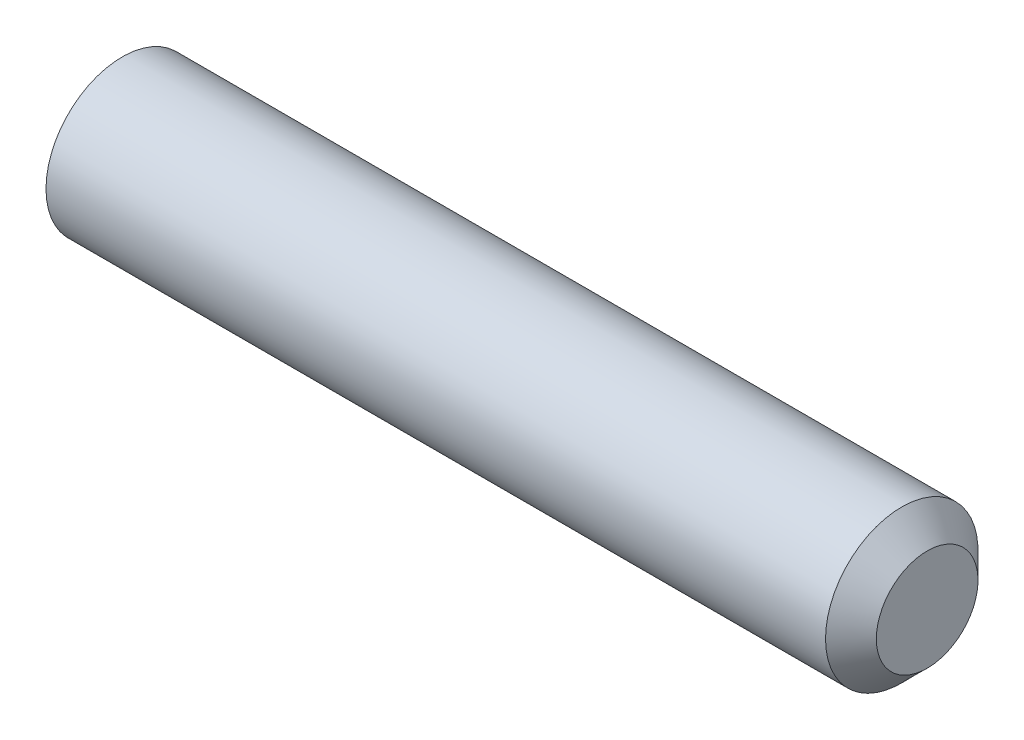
ISO-10303-21;
HEADER;
FILE_DESCRIPTION(('STEP AP214'),'2;1');
FILE_NAME('part.step','',(''),(''),'','','');
FILE_SCHEMA(('AUTOMOTIVE_DESIGN { 1 0 10303 214 1 1 1 1 }'));
ENDSEC;
DATA;
#1=APPLICATION_CONTEXT('core data for automotive mechanical design processes');
#2=APPLICATION_PROTOCOL_DEFINITION('international standard','automotive_design',2000,#1);
#3=PRODUCT_CONTEXT('',#1,'mechanical');
#4=PRODUCT('Part','Part','',(#3));
#5=PRODUCT_RELATED_PRODUCT_CATEGORY('part','',(#4));
#6=PRODUCT_DEFINITION_FORMATION('','',#4);
#7=PRODUCT_DEFINITION_CONTEXT('part definition',#1,'design');
#8=PRODUCT_DEFINITION('design','',#6,#7);
#9=PRODUCT_DEFINITION_SHAPE('','',#8);
#10=(LENGTH_UNIT() NAMED_UNIT(*) SI_UNIT(.MILLI.,.METRE.));
#11=(NAMED_UNIT(*) PLANE_ANGLE_UNIT() SI_UNIT($,.RADIAN.));
#12=(NAMED_UNIT(*) SI_UNIT($,.STERADIAN.) SOLID_ANGLE_UNIT());
#13=UNCERTAINTY_MEASURE_WITH_UNIT(LENGTH_MEASURE(1.E-05),#10,'distance_accuracy_value','');
#14=(GEOMETRIC_REPRESENTATION_CONTEXT(3) GLOBAL_UNCERTAINTY_ASSIGNED_CONTEXT((#13)) GLOBAL_UNIT_ASSIGNED_CONTEXT((#10,
#11,#12)) REPRESENTATION_CONTEXT('',''));
#15=CARTESIAN_POINT('',(0.,0.,0.));
#16=DIRECTION('',(0.,0.,1.));
#17=DIRECTION('',(1.,0.,0.));
#18=AXIS2_PLACEMENT_3D('',#15,#16,#17);
#19=CARTESIAN_POINT('',(0.,0.,0.));
#20=DIRECTION('',(-1.,0.,0.));
#21=DIRECTION('',(0.,0.,1.));
#22=AXIS2_PLACEMENT_3D('',#19,#20,#21);
#23=PLANE('',#22);
#24=CARTESIAN_POINT('',(0.,0.,0.));
#25=DIRECTION('',(-1.,0.,0.));
#26=DIRECTION('',(0.,0.,1.));
#27=AXIS2_PLACEMENT_3D('',#24,#25,#26);
#28=CIRCLE('',#27,1.2195);
#29=CARTESIAN_POINT('',(0.,0.,1.2195));
#30=VERTEX_POINT('',#29);
#31=EDGE_CURVE('E133',#30,#30,#28,.T.);
#32=ORIENTED_EDGE('',*,*,#31,.T.);
#33=EDGE_LOOP('',(#32));
#34=FACE_BOUND('',#33,.T.);
#35=DIRECTION('',(0.,0.,-1.));
#36=VECTOR('',#35,1.);
#37=CARTESIAN_POINT('',(0.,0.750000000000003,0.433012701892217));
#38=LINE('',#37,#36);
#39=CARTESIAN_POINT('',(0.,0.750000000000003,0.433012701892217));
#40=VERTEX_POINT('',#39);
#41=CARTESIAN_POINT('',(0.,0.750000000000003,-0.433012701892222));
#42=VERTEX_POINT('',#41);
#43=EDGE_CURVE('E124',#40,#42,#38,.T.);
#44=ORIENTED_EDGE('',*,*,#43,.F.);
#45=DIRECTION('',(0.,-0.866025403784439,0.499999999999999));
#46=VECTOR('',#45,1.);
#47=CARTESIAN_POINT('',(0.,0.750000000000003,0.433012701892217));
#48=LINE('',#47,#46);
#49=CARTESIAN_POINT('',(0.,0.,0.866025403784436));
#50=VERTEX_POINT('',#49);
#51=EDGE_CURVE('E46',#40,#50,#48,.T.);
#52=ORIENTED_EDGE('',*,*,#51,.T.);
#53=DIRECTION('',(0.,0.866025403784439,0.5));
#54=VECTOR('',#53,1.);
#55=CARTESIAN_POINT('',(0.,-0.749999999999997,0.433012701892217));
#56=LINE('',#55,#54);
#57=CARTESIAN_POINT('',(0.,-0.749999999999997,0.433012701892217));
#58=VERTEX_POINT('',#57);
#59=EDGE_CURVE('E115',#58,#50,#56,.T.);
#60=ORIENTED_EDGE('',*,*,#59,.F.);
#61=DIRECTION('',(0.,0.,-1.));
#62=VECTOR('',#61,1.);
#63=CARTESIAN_POINT('',(0.,-0.749999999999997,0.433012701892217));
#64=LINE('',#63,#62);
#65=CARTESIAN_POINT('',(0.,-0.749999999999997,-0.433012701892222));
#66=VERTEX_POINT('',#65);
#67=EDGE_CURVE('E118',#58,#66,#64,.T.);
#68=ORIENTED_EDGE('',*,*,#67,.T.);
#69=DIRECTION('',(0.,0.866025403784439,-0.5));
#70=VECTOR('',#69,1.);
#71=CARTESIAN_POINT('',(0.,-0.749999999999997,-0.433012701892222));
#72=LINE('',#71,#70);
#73=CARTESIAN_POINT('',(0.,0.,-0.866025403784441));
#74=VERTEX_POINT('',#73);
#75=EDGE_CURVE('E121',#66,#74,#72,.T.);
#76=ORIENTED_EDGE('',*,*,#75,.T.);
#77=DIRECTION('',(0.,-0.866025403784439,-0.5));
#78=VECTOR('',#77,1.);
#79=CARTESIAN_POINT('',(0.,0.750000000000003,-0.433012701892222));
#80=LINE('',#79,#78);
#81=EDGE_CURVE('E104',#42,#74,#80,.T.);
#82=ORIENTED_EDGE('',*,*,#81,.F.);
#83=EDGE_LOOP('',(#44,#52,#60,#68,#76,#82));
#84=FACE_BOUND('',#83,.T.);
#85=ADVANCED_FACE('F31',(#34,#84),#23,.T.);
#86=CARTESIAN_POINT('',(16.,1.,0.));
#87=DIRECTION('',(1.,0.,0.));
#88=DIRECTION('',(0.,0.,-1.));
#89=AXIS2_PLACEMENT_3D('',#86,#87,#88);
#90=PLANE('',#89);
#91=CARTESIAN_POINT('',(16.,0.,0.));
#92=DIRECTION('',(-1.,0.,0.));
#93=DIRECTION('',(0.,0.,1.));
#94=AXIS2_PLACEMENT_3D('',#91,#92,#93);
#95=CIRCLE('',#94,1.);
#96=CARTESIAN_POINT('',(16.,0.,1.));
#97=VERTEX_POINT('',#96);
#98=EDGE_CURVE('E11',#97,#97,#95,.T.);
#99=ORIENTED_EDGE('',*,*,#98,.F.);
#100=EDGE_LOOP('',(#99));
#101=FACE_BOUND('',#100,.T.);
#102=ADVANCED_FACE('F33',(#101),#90,.T.);
#103=CARTESIAN_POINT('',(15.5,0.,0.));
#104=DIRECTION('',(-1.,0.,0.));
#105=DIRECTION('',(0.,0.,1.));
#106=AXIS2_PLACEMENT_3D('',#103,#104,#105);
#107=CONICAL_SURFACE('',#106,1.5,0.785398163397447);
#108=ORIENTED_EDGE('',*,*,#98,.T.);
#109=EDGE_LOOP('',(#108));
#110=FACE_BOUND('',#109,.T.);
#111=CARTESIAN_POINT('',(15.5,0.,0.));
#112=DIRECTION('',(-1.,0.,0.));
#113=DIRECTION('',(0.,0.,1.));
#114=AXIS2_PLACEMENT_3D('',#111,#112,#113);
#115=CIRCLE('',#114,1.5);
#116=CARTESIAN_POINT('',(15.5,0.,1.5));
#117=VERTEX_POINT('',#116);
#118=EDGE_CURVE('E39',#117,#117,#115,.T.);
#119=ORIENTED_EDGE('',*,*,#118,.F.);
#120=EDGE_LOOP('',(#119));
#121=FACE_BOUND('',#120,.T.);
#122=ADVANCED_FACE('F144',(#110,#121),#107,.T.);
#123=CARTESIAN_POINT('',(-12.7,0.,0.));
#124=DIRECTION('',(-1.,0.,0.));
#125=DIRECTION('',(0.,0.,1.));
#126=AXIS2_PLACEMENT_3D('',#123,#124,#125);
#127=CYLINDRICAL_SURFACE('',#126,1.5);
#128=ORIENTED_EDGE('',*,*,#118,.T.);
#129=EDGE_LOOP('',(#128));
#130=FACE_BOUND('',#129,.T.);
#131=CARTESIAN_POINT('',(0.161946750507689,0.,0.));
#132=DIRECTION('',(-1.,0.,0.));
#133=DIRECTION('',(0.,0.,1.));
#134=AXIS2_PLACEMENT_3D('',#131,#132,#133);
#135=CIRCLE('',#134,1.5);
#136=CARTESIAN_POINT('',(0.161946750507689,0.,1.5));
#137=VERTEX_POINT('',#136);
#138=EDGE_CURVE('E136',#137,#137,#135,.T.);
#139=ORIENTED_EDGE('',*,*,#138,.F.);
#140=EDGE_LOOP('',(#139));
#141=FACE_BOUND('',#140,.T.);
#142=ADVANCED_FACE('F141',(#130,#141),#127,.T.);
#143=CARTESIAN_POINT('',(0.,0.,0.));
#144=DIRECTION('',(1.,0.,0.));
#145=DIRECTION('',(0.,0.,-1.));
#146=AXIS2_PLACEMENT_3D('',#143,#144,#145);
#147=CONICAL_SURFACE('',#146,1.2195,1.0471975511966);
#148=ORIENTED_EDGE('',*,*,#138,.T.);
#149=EDGE_LOOP('',(#148));
#150=FACE_BOUND('',#149,.T.);
#151=ORIENTED_EDGE('',*,*,#31,.F.);
#152=EDGE_LOOP('',(#151));
#153=FACE_BOUND('',#152,.T.);
#154=ADVANCED_FACE('F151',(#150,#153),#147,.T.);
#155=CARTESIAN_POINT('',(2.,0.750000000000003,0.433012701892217));
#156=DIRECTION('',(0.,-0.5,-0.866025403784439));
#157=DIRECTION('',(0.,0.866025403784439,-0.5));
#158=AXIS2_PLACEMENT_3D('',#155,#156,#157);
#159=PLANE('',#158);
#160=ORIENTED_EDGE('',*,*,#51,.F.);
#161=DIRECTION('',(-1.,0.,0.));
#162=VECTOR('',#161,1.);
#163=CARTESIAN_POINT('',(2.,0.750000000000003,0.433012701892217));
#164=LINE('',#163,#162);
#165=CARTESIAN_POINT('',(2.,0.750000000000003,0.433012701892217));
#166=VERTEX_POINT('',#165);
#167=EDGE_CURVE('E51',#166,#40,#164,.T.);
#168=ORIENTED_EDGE('',*,*,#167,.F.);
#169=DIRECTION('',(0.,-0.866025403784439,0.499999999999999));
#170=VECTOR('',#169,1.);
#171=CARTESIAN_POINT('',(2.,0.750000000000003,0.433012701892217));
#172=LINE('',#171,#170);
#173=CARTESIAN_POINT('',(2.,0.,0.866025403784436));
#174=VERTEX_POINT('',#173);
#175=EDGE_CURVE('E78',#166,#174,#172,.T.);
#176=ORIENTED_EDGE('',*,*,#175,.T.);
#177=DIRECTION('',(-1.,0.,0.));
#178=VECTOR('',#177,1.);
#179=CARTESIAN_POINT('',(2.,0.,0.866025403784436));
#180=LINE('',#179,#178);
#181=EDGE_CURVE('E131',#174,#50,#180,.T.);
#182=ORIENTED_EDGE('',*,*,#181,.T.);
#183=EDGE_LOOP('',(#160,#168,#176,#182));
#184=FACE_BOUND('',#183,.T.);
#185=ADVANCED_FACE('F162',(#184),#159,.T.);
#186=CARTESIAN_POINT('',(2.,-0.749999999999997,0.433012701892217));
#187=DIRECTION('',(0.,-0.5,0.866025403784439));
#188=DIRECTION('',(0.,-0.866025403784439,-0.5));
#189=AXIS2_PLACEMENT_3D('',#186,#187,#188);
#190=PLANE('',#189);
#191=ORIENTED_EDGE('',*,*,#59,.T.);
#192=ORIENTED_EDGE('',*,*,#181,.F.);
#193=DIRECTION('',(0.,0.866025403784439,0.5));
#194=VECTOR('',#193,1.);
#195=CARTESIAN_POINT('',(2.,-0.749999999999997,0.433012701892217));
#196=LINE('',#195,#194);
#197=CARTESIAN_POINT('',(2.,-0.749999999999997,0.433012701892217));
#198=VERTEX_POINT('',#197);
#199=EDGE_CURVE('E260',#198,#174,#196,.T.);
#200=ORIENTED_EDGE('',*,*,#199,.F.);
#201=DIRECTION('',(-1.,0.,0.));
#202=VECTOR('',#201,1.);
#203=CARTESIAN_POINT('',(2.,-0.749999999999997,0.433012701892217));
#204=LINE('',#203,#202);
#205=EDGE_CURVE('E129',#198,#58,#204,.T.);
#206=ORIENTED_EDGE('',*,*,#205,.T.);
#207=EDGE_LOOP('',(#191,#192,#200,#206));
#208=FACE_BOUND('',#207,.T.);
#209=ADVANCED_FACE('F169',(#208),#190,.F.);
#210=CARTESIAN_POINT('',(2.,-0.749999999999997,0.433012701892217));
#211=DIRECTION('',(0.,1.,0.));
#212=DIRECTION('',(0.,0.,1.));
#213=AXIS2_PLACEMENT_3D('',#210,#211,#212);
#214=PLANE('',#213);
#215=ORIENTED_EDGE('',*,*,#67,.F.);
#216=ORIENTED_EDGE('',*,*,#205,.F.);
#217=DIRECTION('',(0.,0.,-1.));
#218=VECTOR('',#217,1.);
#219=CARTESIAN_POINT('',(2.,-0.749999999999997,0.433012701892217));
#220=LINE('',#219,#218);
#221=CARTESIAN_POINT('',(2.,-0.749999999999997,-0.433012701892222));
#222=VERTEX_POINT('',#221);
#223=EDGE_CURVE('E99',#198,#222,#220,.T.);
#224=ORIENTED_EDGE('',*,*,#223,.T.);
#225=DIRECTION('',(-1.,0.,0.));
#226=VECTOR('',#225,1.);
#227=CARTESIAN_POINT('',(2.,-0.749999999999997,-0.433012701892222));
#228=LINE('',#227,#226);
#229=EDGE_CURVE('E94',#222,#66,#228,.T.);
#230=ORIENTED_EDGE('',*,*,#229,.T.);
#231=EDGE_LOOP('',(#215,#216,#224,#230));
#232=FACE_BOUND('',#231,.T.);
#233=ADVANCED_FACE('F176',(#232),#214,.T.);
#234=CARTESIAN_POINT('',(2.,-0.749999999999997,-0.433012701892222));
#235=DIRECTION('',(0.,0.5,0.866025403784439));
#236=DIRECTION('',(0.,-0.866025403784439,0.5));
#237=AXIS2_PLACEMENT_3D('',#234,#235,#236);
#238=PLANE('',#237);
#239=ORIENTED_EDGE('',*,*,#75,.F.);
#240=ORIENTED_EDGE('',*,*,#229,.F.);
#241=DIRECTION('',(0.,0.866025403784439,-0.5));
#242=VECTOR('',#241,1.);
#243=CARTESIAN_POINT('',(2.,-0.749999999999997,-0.433012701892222));
#244=LINE('',#243,#242);
#245=CARTESIAN_POINT('',(2.,0.,-0.866025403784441));
#246=VERTEX_POINT('',#245);
#247=EDGE_CURVE('E89',#222,#246,#244,.T.);
#248=ORIENTED_EDGE('',*,*,#247,.T.);
#249=DIRECTION('',(-1.,0.,0.));
#250=VECTOR('',#249,1.);
#251=CARTESIAN_POINT('',(2.,0.,-0.866025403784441));
#252=LINE('',#251,#250);
#253=EDGE_CURVE('E93',#246,#74,#252,.T.);
#254=ORIENTED_EDGE('',*,*,#253,.T.);
#255=EDGE_LOOP('',(#239,#240,#248,#254));
#256=FACE_BOUND('',#255,.T.);
#257=ADVANCED_FACE('F92',(#256),#238,.T.);
#258=CARTESIAN_POINT('',(2.,0.750000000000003,-0.433012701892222));
#259=DIRECTION('',(0.,0.5,-0.866025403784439));
#260=DIRECTION('',(0.,0.866025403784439,0.5));
#261=AXIS2_PLACEMENT_3D('',#258,#259,#260);
#262=PLANE('',#261);
#263=ORIENTED_EDGE('',*,*,#81,.T.);
#264=ORIENTED_EDGE('',*,*,#253,.F.);
#265=DIRECTION('',(0.,-0.866025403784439,-0.5));
#266=VECTOR('',#265,1.);
#267=CARTESIAN_POINT('',(2.,0.750000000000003,-0.433012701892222));
#268=LINE('',#267,#266);
#269=CARTESIAN_POINT('',(2.,0.750000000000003,-0.433012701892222));
#270=VERTEX_POINT('',#269);
#271=EDGE_CURVE('E98',#270,#246,#268,.T.);
#272=ORIENTED_EDGE('',*,*,#271,.F.);
#273=DIRECTION('',(-1.,0.,0.));
#274=VECTOR('',#273,1.);
#275=CARTESIAN_POINT('',(2.,0.750000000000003,-0.433012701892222));
#276=LINE('',#275,#274);
#277=EDGE_CURVE('E74',#270,#42,#276,.T.);
#278=ORIENTED_EDGE('',*,*,#277,.T.);
#279=EDGE_LOOP('',(#263,#264,#272,#278));
#280=FACE_BOUND('',#279,.T.);
#281=ADVANCED_FACE('F101',(#280),#262,.F.);
#282=CARTESIAN_POINT('',(2.,0.750000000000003,0.433012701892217));
#283=DIRECTION('',(0.,1.,0.));
#284=DIRECTION('',(0.,0.,1.));
#285=AXIS2_PLACEMENT_3D('',#282,#283,#284);
#286=PLANE('',#285);
#287=ORIENTED_EDGE('',*,*,#43,.T.);
#288=ORIENTED_EDGE('',*,*,#277,.F.);
#289=DIRECTION('',(0.,0.,-1.));
#290=VECTOR('',#289,1.);
#291=CARTESIAN_POINT('',(2.,0.750000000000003,0.433012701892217));
#292=LINE('',#291,#290);
#293=EDGE_CURVE('E109',#166,#270,#292,.T.);
#294=ORIENTED_EDGE('',*,*,#293,.F.);
#295=ORIENTED_EDGE('',*,*,#167,.T.);
#296=EDGE_LOOP('',(#287,#288,#294,#295));
#297=FACE_BOUND('',#296,.T.);
#298=ADVANCED_FACE('F188',(#297),#286,.F.);
#299=CARTESIAN_POINT('',(2.,0.750000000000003,0.433012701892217));
#300=DIRECTION('',(1.,0.,0.));
#301=DIRECTION('',(0.,0.,-1.));
#302=AXIS2_PLACEMENT_3D('',#299,#300,#301);
#303=PLANE('',#302);
#304=ORIENTED_EDGE('',*,*,#175,.F.);
#305=ORIENTED_EDGE('',*,*,#293,.T.);
#306=ORIENTED_EDGE('',*,*,#271,.T.);
#307=ORIENTED_EDGE('',*,*,#247,.F.);
#308=ORIENTED_EDGE('',*,*,#223,.F.);
#309=ORIENTED_EDGE('',*,*,#199,.T.);
#310=EDGE_LOOP('',(#304,#305,#306,#307,#308,#309));
#311=FACE_BOUND('',#310,.T.);
#312=ADVANCED_FACE('F107',(#311),#303,.F.);
#313=CLOSED_SHELL('',(#85,#102,#122,#142,#154,#185,#209,#233,#257,#281,#298,#312));
#314=MANIFOLD_SOLID_BREP('B2',#313);
#315=ADVANCED_BREP_SHAPE_REPRESENTATION('',(#18,#314),#14);
#316=SHAPE_DEFINITION_REPRESENTATION(#9,#315);
ENDSEC;
END-ISO-10303-21;
